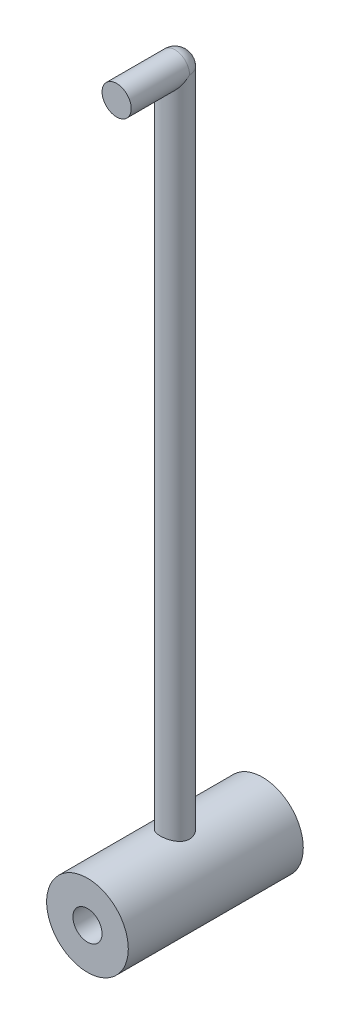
from build123d import *

# Parameters (mm, degrees)
BASE_EXTRUSION_DEPTH      = 15
BASE_EXTRUSION_DEPTH_BACK = 15
ESQUISSE1_R               = 7
ESQUISSE2_R               = 2.5
BOSS_EXTRU_1_DEPTH        = 120
ESQUISSE3_R               = 2.5
BOSS_EXTRU_2_DEPTH        = 10
ESQUISSE5_R               = 2.5
ENL_V_MAT_EXTRU_1_DEPTH   = 49


with BuildPart() as part:
    # Esquisse1 → Base-Extrusion (new, two sides: drawn at the far end of the back side and taken through both)
    with BuildSketch(Plane.XY.offset(-BASE_EXTRUSION_DEPTH_BACK)):
        Circle(ESQUISSE1_R)
    extrude(amount=BASE_EXTRUSION_DEPTH + BASE_EXTRUSION_DEPTH_BACK)

    # Esquisse2 → Boss.-Extru.1 (add)
    with BuildSketch(Plane(origin=(0, 0, 0), x_dir=(1, 0, 0), z_dir=(0, 1, 0))):
        with Locations(Location((0, 0, 0), (0, 0, 90))):
            Circle(ESQUISSE2_R)
    extrude(amount=BOSS_EXTRU_1_DEPTH)

    # Esquisse3 → Boss.-Extru.2 (add)
    with BuildSketch(Plane.XY):
        with Locations((0, 120)):
            Circle(ESQUISSE3_R)
    extrude(amount=BOSS_EXTRU_2_DEPTH)

    # Esquisse4 → Boss.-R_vol.1 (revolve)
    with BuildSketch(Plane(origin=(0, 0, 0), x_dir=(-1, 0, 0), z_dir=(0, 0, -1))):
        with BuildLine():
            Line((-2.5, 120), (2.5, 120))
            ThreePointArc((2.5, 120), (0, 122.5), (-2.5, 120))
        make_face()
    revolve(axis=Axis((3.866390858, 120, 0), (-1, 0, 0)))

    # Esquisse5 → Enl_v. mat.-Extru.1 (cut)
    with BuildSketch(Plane(origin=(0, 0, -15), x_dir=(-1, 0, 0), z_dir=(0, 0, -1))):
        Circle(ESQUISSE5_R)
    extrude(amount=-ENL_V_MAT_EXTRU_1_DEPTH, mode=Mode.SUBTRACT)


solid = part.part
